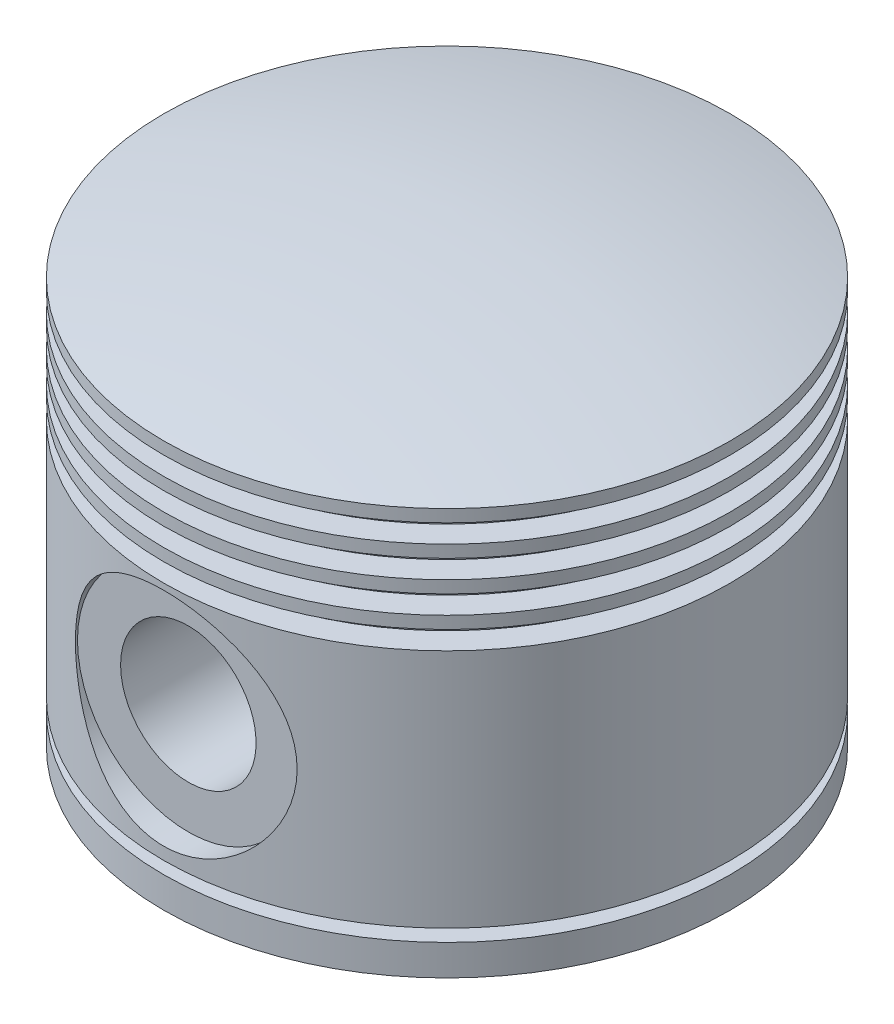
from build123d import *

# Parameters (mm, degrees)
EXTRUDE1_REACH = 112.885
SKETCH4_R      = 19


with BuildPart() as part:
    # Sketch1 → Revolve1 (revolve)
    with BuildSketch(Plane.XY, mode=Mode.PRIVATE) as revolve1_sk:
        with BuildLine():
            Line((46, 0), (46, 5))
            Line((46, 5), (42.5, 5))
            Line((42.5, 5), (42.5, 7))
            Line((42.5, 7), (46, 7))
            Line((46, 7), (46, 46))
            Line((46, 46), (42, 46))
            Line((42, 46), (42, 49))
            Line((42, 49), (46, 49))
            Line((46, 49), (46, 51))
            Line((46, 51), (42, 51))
            Line((42, 51), (42, 54))
            Line((42, 54), (46, 54))
            Line((46, 54), (46, 56))
            Line((46, 56), (42, 56))
            Line((42, 56), (42, 59))
            Line((42, 59), (46, 59))
            Line((46, 59), (46, 61))
            Line((46, 61), (42, 61))
            Line((42, 61), (42, 64))
            Line((42, 64), (46, 64))
            Line((46, 64), (46, 66))
            ThreePointArc((46, 66), (23.174880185, 70.257119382), (0, 71.683334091))
            Line((0, 71.683334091), (0, 62))
            Line((0, 62), (37, 62))
            Line((37, 62), (37, 42))
            Line((37, 42), (38.5, 42))
            Line((38.5, 42), (38.5, 12))
            Line((38.5, 12), (37, 12))
            Line((37, 12), (37, 0))
            Line((37, 0), (46, 0))
        make_face()
    revolve(revolve1_sk.sketch.rotate(Axis((0, 0, 0), (0, 1, 0)), 90), axis=Axis((0, 0, 0), (0, 1, 0)))

    # Sketch4 → Extrude1 (add, up to next)
    with BuildSketch(Plane.XY.offset(-25), mode=Mode.PRIVATE) as extrude1_sk1:
        with Locations((0, 27)):
            Circle(SKETCH4_R)
    extrude1_tool1 = extrude(extrude1_sk1.sketch, amount=-EXTRUDE1_REACH, mode=Mode.PRIVATE) - part.part
    extrude1 = extrude1_tool1.solids().sort_by_distance((0, 27, -25))[0]
    add(extrude1)

    # Sketch6 → Cut-Revolve1 (revolve, cut)
    with BuildSketch(Plane.ZY, mode=Mode.PRIVATE) as cut_revolve1_sk:
        Polygon((-46, 27), (-46, 45), (-42, 45), (-42, 38), (-25, 38), (-25, 27), align=None)
    cut_revolve1 = revolve(cut_revolve1_sk.sketch.rotate(Axis((0, 27, -59.607039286), (0, 0, 1)), 90), axis=Axis((0, 27, -59.607039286), (0, 0, 1)), mode=Mode.SUBTRACT)

    # Mirror1: Extrude1, Cut-Revolve1 across plane
    add(extrude1.mirror(Plane.XY))
    add(cut_revolve1.mirror(Plane.XY), mode=Mode.SUBTRACT)


solid = part.part
